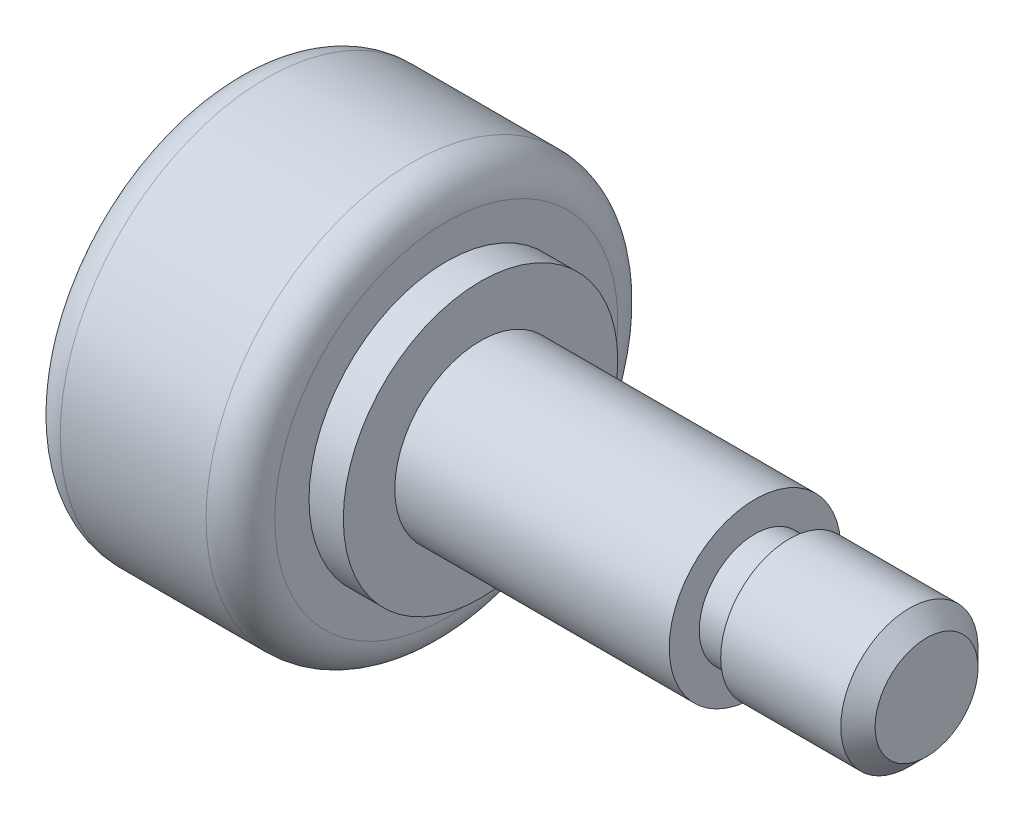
ISO-10303-21;
HEADER;
FILE_DESCRIPTION(('STEP AP214'),'2;1');
FILE_NAME('part.step','',(''),(''),'','','');
FILE_SCHEMA(('AUTOMOTIVE_DESIGN { 1 0 10303 214 1 1 1 1 }'));
ENDSEC;
DATA;
#1=APPLICATION_CONTEXT('core data for automotive mechanical design processes');
#2=APPLICATION_PROTOCOL_DEFINITION('international standard','automotive_design',2000,#1);
#3=PRODUCT_CONTEXT('',#1,'mechanical');
#4=PRODUCT('Part','Part','',(#3));
#5=PRODUCT_RELATED_PRODUCT_CATEGORY('part','',(#4));
#6=PRODUCT_DEFINITION_FORMATION('','',#4);
#7=PRODUCT_DEFINITION_CONTEXT('part definition',#1,'design');
#8=PRODUCT_DEFINITION('design','',#6,#7);
#9=PRODUCT_DEFINITION_SHAPE('','',#8);
#10=(LENGTH_UNIT() NAMED_UNIT(*) SI_UNIT(.MILLI.,.METRE.));
#11=(NAMED_UNIT(*) PLANE_ANGLE_UNIT() SI_UNIT($,.RADIAN.));
#12=(NAMED_UNIT(*) SI_UNIT($,.STERADIAN.) SOLID_ANGLE_UNIT());
#13=UNCERTAINTY_MEASURE_WITH_UNIT(LENGTH_MEASURE(1.E-05),#10,'distance_accuracy_value','');
#14=(GEOMETRIC_REPRESENTATION_CONTEXT(3) GLOBAL_UNCERTAINTY_ASSIGNED_CONTEXT((#13)) GLOBAL_UNIT_ASSIGNED_CONTEXT((#10,
#11,#12)) REPRESENTATION_CONTEXT('',''));
#15=CARTESIAN_POINT('',(0.,0.,0.));
#16=DIRECTION('',(0.,0.,1.));
#17=DIRECTION('',(1.,0.,0.));
#18=AXIS2_PLACEMENT_3D('',#15,#16,#17);
#19=CARTESIAN_POINT('',(0.,0.,0.));
#20=DIRECTION('',(-1.,0.,0.));
#21=DIRECTION('',(0.,0.,1.));
#22=AXIS2_PLACEMENT_3D('',#19,#20,#21);
#23=PLANE('',#22);
#24=CARTESIAN_POINT('',(0.,0.,0.));
#25=DIRECTION('',(-1.,0.,0.));
#26=DIRECTION('',(0.,0.,1.));
#27=AXIS2_PLACEMENT_3D('',#24,#25,#26);
#28=CIRCLE('',#27,3.);
#29=CARTESIAN_POINT('',(0.,0.,3.));
#30=VERTEX_POINT('',#29);
#31=EDGE_CURVE('E10',#30,#30,#28,.F.);
#32=ORIENTED_EDGE('',*,*,#31,.T.);
#33=EDGE_LOOP('',(#32));
#34=FACE_BOUND('',#33,.T.);
#35=ADVANCED_FACE('F32',(#34),#23,.F.);
#36=CARTESIAN_POINT('',(-41.8424319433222,0.,0.));
#37=DIRECTION('',(-1.,0.,0.));
#38=DIRECTION('',(0.,0.,1.));
#39=AXIS2_PLACEMENT_3D('',#36,#37,#38);
#40=CYLINDRICAL_SURFACE('',#39,4.);
#41=CARTESIAN_POINT('',(-1.00000000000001,0.,0.));
#42=DIRECTION('',(-1.,0.,0.));
#43=DIRECTION('',(0.,0.,1.));
#44=AXIS2_PLACEMENT_3D('',#41,#42,#43);
#45=CIRCLE('',#44,4.);
#46=CARTESIAN_POINT('',(-1.00000000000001,0.,4.));
#47=VERTEX_POINT('',#46);
#48=EDGE_CURVE('E39',#47,#47,#45,.T.);
#49=ORIENTED_EDGE('',*,*,#48,.T.);
#50=EDGE_LOOP('',(#49));
#51=FACE_BOUND('',#50,.T.);
#52=CARTESIAN_POINT('',(-8.,0.,0.));
#53=DIRECTION('',(-1.,0.,0.));
#54=DIRECTION('',(0.,0.,1.));
#55=AXIS2_PLACEMENT_3D('',#52,#53,#54);
#56=CIRCLE('',#55,4.);
#57=CARTESIAN_POINT('',(-8.,0.,4.));
#58=VERTEX_POINT('',#57);
#59=EDGE_CURVE('E58',#58,#58,#56,.T.);
#60=ORIENTED_EDGE('',*,*,#59,.F.);
#61=EDGE_LOOP('',(#60));
#62=FACE_BOUND('',#61,.T.);
#63=ADVANCED_FACE('F115',(#51,#62),#40,.T.);
#64=CARTESIAN_POINT('',(-8.,4.,0.));
#65=DIRECTION('',(1.,0.,0.));
#66=DIRECTION('',(0.,0.,-1.));
#67=AXIS2_PLACEMENT_3D('',#64,#65,#66);
#68=PLANE('',#67);
#69=CARTESIAN_POINT('',(-8.,0.,0.));
#70=DIRECTION('',(-1.,0.,0.));
#71=DIRECTION('',(0.,0.,1.));
#72=AXIS2_PLACEMENT_3D('',#69,#70,#71);
#73=CIRCLE('',#72,3.25);
#74=CARTESIAN_POINT('',(-8.,0.,3.25));
#75=VERTEX_POINT('',#74);
#76=EDGE_CURVE('E61',#75,#75,#73,.T.);
#77=ORIENTED_EDGE('',*,*,#76,.F.);
#78=EDGE_LOOP('',(#77));
#79=FACE_BOUND('',#78,.T.);
#80=ORIENTED_EDGE('',*,*,#59,.T.);
#81=EDGE_LOOP('',(#80));
#82=FACE_BOUND('',#81,.T.);
#83=ADVANCED_FACE('F109',(#79,#82),#68,.F.);
#84=CARTESIAN_POINT('',(-41.8424319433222,0.,0.));
#85=DIRECTION('',(-1.,0.,0.));
#86=DIRECTION('',(0.,0.,1.));
#87=AXIS2_PLACEMENT_3D('',#84,#85,#86);
#88=CYLINDRICAL_SURFACE('',#87,3.25);
#89=CARTESIAN_POINT('',(-10.,0.,0.));
#90=DIRECTION('',(-1.,0.,0.));
#91=DIRECTION('',(0.,0.,1.));
#92=AXIS2_PLACEMENT_3D('',#89,#90,#91);
#93=CIRCLE('',#92,3.25);
#94=CARTESIAN_POINT('',(-10.,0.,3.25));
#95=VERTEX_POINT('',#94);
#96=EDGE_CURVE('E64',#95,#95,#93,.T.);
#97=ORIENTED_EDGE('',*,*,#96,.F.);
#98=EDGE_LOOP('',(#97));
#99=FACE_BOUND('',#98,.T.);
#100=ORIENTED_EDGE('',*,*,#76,.T.);
#101=EDGE_LOOP('',(#100));
#102=FACE_BOUND('',#101,.T.);
#103=ADVANCED_FACE('F103',(#99,#102),#88,.T.);
#104=CARTESIAN_POINT('',(-10.,3.25,0.));
#105=DIRECTION('',(-1.,0.,0.));
#106=DIRECTION('',(0.,0.,1.));
#107=AXIS2_PLACEMENT_3D('',#104,#105,#106);
#108=PLANE('',#107);
#109=CARTESIAN_POINT('',(-10.,0.,0.));
#110=DIRECTION('',(-1.,0.,0.));
#111=DIRECTION('',(0.,0.,1.));
#112=AXIS2_PLACEMENT_3D('',#109,#110,#111);
#113=CIRCLE('',#112,5.);
#114=CARTESIAN_POINT('',(-10.,0.,5.));
#115=VERTEX_POINT('',#114);
#116=EDGE_CURVE('E67',#115,#115,#113,.T.);
#117=ORIENTED_EDGE('',*,*,#116,.F.);
#118=EDGE_LOOP('',(#117));
#119=FACE_BOUND('',#118,.T.);
#120=ORIENTED_EDGE('',*,*,#96,.T.);
#121=EDGE_LOOP('',(#120));
#122=FACE_BOUND('',#121,.T.);
#123=ADVANCED_FACE('F97',(#119,#122),#108,.F.);
#124=CARTESIAN_POINT('',(-41.8424319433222,0.,0.));
#125=DIRECTION('',(-1.,0.,0.));
#126=DIRECTION('',(0.,0.,1.));
#127=AXIS2_PLACEMENT_3D('',#124,#125,#126);
#128=CYLINDRICAL_SURFACE('',#127,5.);
#129=CARTESIAN_POINT('',(-26.,0.,0.));
#130=DIRECTION('',(-1.,0.,0.));
#131=DIRECTION('',(0.,0.,1.));
#132=AXIS2_PLACEMENT_3D('',#129,#130,#131);
#133=CIRCLE('',#132,5.);
#134=CARTESIAN_POINT('',(-26.,0.,5.));
#135=VERTEX_POINT('',#134);
#136=EDGE_CURVE('E70',#135,#135,#133,.T.);
#137=ORIENTED_EDGE('',*,*,#136,.F.);
#138=EDGE_LOOP('',(#137));
#139=FACE_BOUND('',#138,.T.);
#140=ORIENTED_EDGE('',*,*,#116,.T.);
#141=EDGE_LOOP('',(#140));
#142=FACE_BOUND('',#141,.T.);
#143=ADVANCED_FACE('F91',(#139,#142),#128,.T.);
#144=CARTESIAN_POINT('',(-26.,5.,0.));
#145=DIRECTION('',(-1.,0.,0.));
#146=DIRECTION('',(0.,0.,1.));
#147=AXIS2_PLACEMENT_3D('',#144,#145,#146);
#148=PLANE('',#147);
#149=CARTESIAN_POINT('',(-26.,0.,0.));
#150=DIRECTION('',(-1.,0.,0.));
#151=DIRECTION('',(0.,0.,1.));
#152=AXIS2_PLACEMENT_3D('',#149,#150,#151);
#153=CIRCLE('',#152,8.);
#154=CARTESIAN_POINT('',(-26.,0.,8.));
#155=VERTEX_POINT('',#154);
#156=EDGE_CURVE('E73',#155,#155,#153,.T.);
#157=ORIENTED_EDGE('',*,*,#156,.F.);
#158=EDGE_LOOP('',(#157));
#159=FACE_BOUND('',#158,.T.);
#160=ORIENTED_EDGE('',*,*,#136,.T.);
#161=EDGE_LOOP('',(#160));
#162=FACE_BOUND('',#161,.T.);
#163=ADVANCED_FACE('F85',(#159,#162),#148,.F.);
#164=CARTESIAN_POINT('',(-41.8424319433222,0.,0.));
#165=DIRECTION('',(-1.,0.,0.));
#166=DIRECTION('',(0.,0.,1.));
#167=AXIS2_PLACEMENT_3D('',#164,#165,#166);
#168=CYLINDRICAL_SURFACE('',#167,8.);
#169=CARTESIAN_POINT('',(-28.,0.,0.));
#170=DIRECTION('',(-1.,0.,0.));
#171=DIRECTION('',(0.,0.,1.));
#172=AXIS2_PLACEMENT_3D('',#169,#170,#171);
#173=CIRCLE('',#172,8.);
#174=CARTESIAN_POINT('',(-28.,0.,8.));
#175=VERTEX_POINT('',#174);
#176=EDGE_CURVE('E76',#175,#175,#173,.T.);
#177=ORIENTED_EDGE('',*,*,#176,.F.);
#178=EDGE_LOOP('',(#177));
#179=FACE_BOUND('',#178,.T.);
#180=ORIENTED_EDGE('',*,*,#156,.T.);
#181=EDGE_LOOP('',(#180));
#182=FACE_BOUND('',#181,.T.);
#183=ADVANCED_FACE('F82',(#179,#182),#168,.T.);
#184=CARTESIAN_POINT('',(-28.,8.,0.));
#185=DIRECTION('',(-1.,0.,0.));
#186=DIRECTION('',(0.,0.,1.));
#187=AXIS2_PLACEMENT_3D('',#184,#185,#186);
#188=PLANE('',#187);
#189=CARTESIAN_POINT('',(-28.,0.,0.));
#190=DIRECTION('',(-1.,0.,0.));
#191=DIRECTION('',(0.,0.,1.));
#192=AXIS2_PLACEMENT_3D('',#189,#190,#191);
#193=CIRCLE('',#192,10.);
#194=CARTESIAN_POINT('',(-28.,0.,10.));
#195=VERTEX_POINT('',#194);
#196=EDGE_CURVE('E43',#195,#195,#193,.F.);
#197=ORIENTED_EDGE('',*,*,#196,.T.);
#198=EDGE_LOOP('',(#197));
#199=FACE_BOUND('',#198,.T.);
#200=ORIENTED_EDGE('',*,*,#176,.T.);
#201=EDGE_LOOP('',(#200));
#202=FACE_BOUND('',#201,.T.);
#203=ADVANCED_FACE('F80',(#199,#202),#188,.F.);
#204=CARTESIAN_POINT('',(-41.8424319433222,0.,0.));
#205=DIRECTION('',(-1.,0.,0.));
#206=DIRECTION('',(0.,0.,1.));
#207=AXIS2_PLACEMENT_3D('',#204,#205,#206);
#208=CYLINDRICAL_SURFACE('',#207,12.);
#209=CARTESIAN_POINT('',(-38.5030375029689,0.,0.));
#210=DIRECTION('',(1.,0.,0.));
#211=DIRECTION('',(0.,0.,-1.));
#212=AXIS2_PLACEMENT_3D('',#209,#210,#211);
#213=CIRCLE('',#212,12.);
#214=CARTESIAN_POINT('',(-38.5030375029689,0.,-12.));
#215=VERTEX_POINT('',#214);
#216=EDGE_CURVE('E47',#215,#215,#213,.T.);
#217=ORIENTED_EDGE('',*,*,#216,.T.);
#218=EDGE_LOOP('',(#217));
#219=FACE_BOUND('',#218,.T.);
#220=CARTESIAN_POINT('',(-30.,0.,0.));
#221=DIRECTION('',(-1.,0.,0.));
#222=DIRECTION('',(0.,0.,1.));
#223=AXIS2_PLACEMENT_3D('',#220,#221,#222);
#224=CIRCLE('',#223,12.);
#225=CARTESIAN_POINT('',(-30.,0.,12.));
#226=VERTEX_POINT('',#225);
#227=EDGE_CURVE('E52',#226,#226,#224,.T.);
#228=ORIENTED_EDGE('',*,*,#227,.T.);
#229=EDGE_LOOP('',(#228));
#230=FACE_BOUND('',#229,.T.);
#231=ADVANCED_FACE('F141',(#219,#230),#208,.T.);
#232=CARTESIAN_POINT('',(-1.84243194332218,0.,0.));
#233=DIRECTION('',(-1.,0.,0.));
#234=DIRECTION('',(0.,1.,0.));
#235=AXIS2_PLACEMENT_3D('',#232,#233,#234);
#236=SPHERICAL_SURFACE('',#235,40.);
#237=CARTESIAN_POINT('',(-40.4325430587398,0.,0.));
#238=DIRECTION('',(1.,0.,0.));
#239=DIRECTION('',(0.,0.,-1.));
#240=AXIS2_PLACEMENT_3D('',#237,#238,#239);
#241=CIRCLE('',#240,10.5263157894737);
#242=CARTESIAN_POINT('',(-40.4325430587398,0.,-10.5263157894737));
#243=VERTEX_POINT('',#242);
#244=EDGE_CURVE('E55',#243,#243,#241,.F.);
#245=ORIENTED_EDGE('',*,*,#244,.T.);
#246=EDGE_LOOP('',(#245));
#247=FACE_BOUND('',#246,.T.);
#248=ADVANCED_FACE('F129',(#247),#236,.T.);
#249=CARTESIAN_POINT('',(-38.5030375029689,0.,0.));
#250=DIRECTION('',(1.,0.,0.));
#251=DIRECTION('',(0.,0.,-1.));
#252=AXIS2_PLACEMENT_3D('',#249,#250,#251);
#253=TOROIDAL_SURFACE('',#252,10.,2.);
#254=ORIENTED_EDGE('',*,*,#216,.F.);
#255=EDGE_LOOP('',(#254));
#256=FACE_BOUND('',#255,.T.);
#257=ORIENTED_EDGE('',*,*,#244,.F.);
#258=EDGE_LOOP('',(#257));
#259=FACE_BOUND('',#258,.T.);
#260=ADVANCED_FACE('F126',(#256,#259),#253,.T.);
#261=CARTESIAN_POINT('',(-30.,0.,0.));
#262=DIRECTION('',(-1.,0.,0.));
#263=DIRECTION('',(0.,0.,1.));
#264=AXIS2_PLACEMENT_3D('',#261,#262,#263);
#265=TOROIDAL_SURFACE('',#264,10.,2.);
#266=ORIENTED_EDGE('',*,*,#196,.F.);
#267=EDGE_LOOP('',(#266));
#268=FACE_BOUND('',#267,.T.);
#269=ORIENTED_EDGE('',*,*,#227,.F.);
#270=EDGE_LOOP('',(#269));
#271=FACE_BOUND('',#270,.T.);
#272=ADVANCED_FACE('F128',(#268,#271),#265,.T.);
#273=CARTESIAN_POINT('',(-1.00000000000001,0.,0.));
#274=DIRECTION('',(-1.,0.,0.));
#275=DIRECTION('',(0.,0.,1.));
#276=AXIS2_PLACEMENT_3D('',#273,#274,#275);
#277=CONICAL_SURFACE('',#276,4.,0.785398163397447);
#278=ORIENTED_EDGE('',*,*,#31,.F.);
#279=EDGE_LOOP('',(#278));
#280=FACE_BOUND('',#279,.T.);
#281=ORIENTED_EDGE('',*,*,#48,.F.);
#282=EDGE_LOOP('',(#281));
#283=FACE_BOUND('',#282,.T.);
#284=ADVANCED_FACE('F34',(#280,#283),#277,.T.);
#285=CLOSED_SHELL('',(#35,#63,#83,#103,#123,#143,#163,#183,#203,#231,#248,#260,#272,#284));
#286=MANIFOLD_SOLID_BREP('B2',#285);
#287=ADVANCED_BREP_SHAPE_REPRESENTATION('',(#18,#286),#14);
#288=SHAPE_DEFINITION_REPRESENTATION(#9,#287);
ENDSEC;
END-ISO-10303-21;
